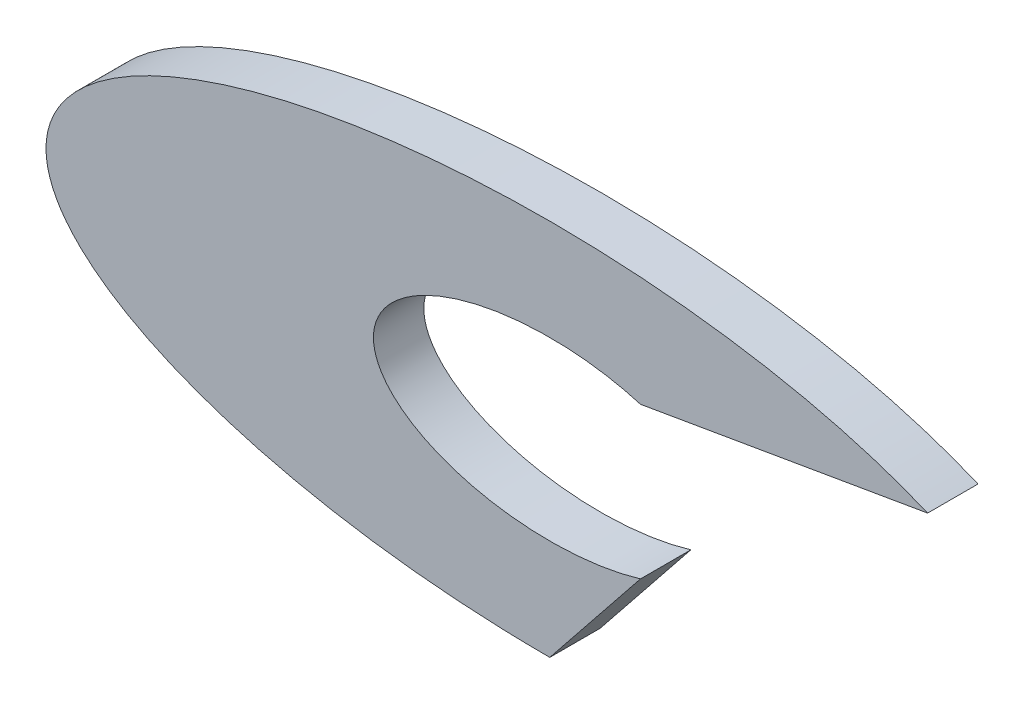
ISO-10303-21;
HEADER;
FILE_DESCRIPTION(('STEP AP214'),'2;1');
FILE_NAME('part.step','',(''),(''),'','','');
FILE_SCHEMA(('AUTOMOTIVE_DESIGN { 1 0 10303 214 1 1 1 1 }'));
ENDSEC;
DATA;
#1=APPLICATION_CONTEXT('core data for automotive mechanical design processes');
#2=APPLICATION_PROTOCOL_DEFINITION('international standard','automotive_design',2000,#1);
#3=PRODUCT_CONTEXT('',#1,'mechanical');
#4=PRODUCT('Part','Part','',(#3));
#5=PRODUCT_RELATED_PRODUCT_CATEGORY('part','',(#4));
#6=PRODUCT_DEFINITION_FORMATION('','',#4);
#7=PRODUCT_DEFINITION_CONTEXT('part definition',#1,'design');
#8=PRODUCT_DEFINITION('design','',#6,#7);
#9=PRODUCT_DEFINITION_SHAPE('','',#8);
#10=(LENGTH_UNIT() NAMED_UNIT(*) SI_UNIT(.MILLI.,.METRE.));
#11=(NAMED_UNIT(*) PLANE_ANGLE_UNIT() SI_UNIT($,.RADIAN.));
#12=(NAMED_UNIT(*) SI_UNIT($,.STERADIAN.) SOLID_ANGLE_UNIT());
#13=UNCERTAINTY_MEASURE_WITH_UNIT(LENGTH_MEASURE(1.E-05),#10,'distance_accuracy_value','');
#14=(GEOMETRIC_REPRESENTATION_CONTEXT(3) GLOBAL_UNCERTAINTY_ASSIGNED_CONTEXT((#13)) GLOBAL_UNIT_ASSIGNED_CONTEXT((#10,
#11,#12)) REPRESENTATION_CONTEXT('',''));
#15=CARTESIAN_POINT('',(0.,0.,0.));
#16=DIRECTION('',(0.,0.,1.));
#17=DIRECTION('',(1.,0.,0.));
#18=AXIS2_PLACEMENT_3D('',#15,#16,#17);
#19=CARTESIAN_POINT('',(0.,0.,10.));
#20=DIRECTION('',(0.,0.,-1.));
#21=DIRECTION('',(1.,0.,0.));
#22=AXIS2_PLACEMENT_3D('',#19,#20,#21);
#23=ELLIPSE('',#22,35.,17.5);
#24=DIRECTION('',(0.,0.,-1.));
#25=VECTOR('',#24,1.);
#26=SURFACE_OF_LINEAR_EXTRUSION('',#23,#25);
#27=CARTESIAN_POINT('',(0.,0.,0.));
#28=DIRECTION('',(0.,0.,-1.));
#29=DIRECTION('',(1.,0.,0.));
#30=AXIS2_PLACEMENT_3D('',#27,#28,#29);
#31=ELLIPSE('',#30,35.,17.5);
#32=CARTESIAN_POINT('',(18.,-15.0083310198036,0.));
#33=VERTEX_POINT('',#32);
#34=CARTESIAN_POINT('',(18.,15.0083310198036,0.));
#35=VERTEX_POINT('',#34);
#36=EDGE_CURVE('E111',#33,#35,#31,.T.);
#37=ORIENTED_EDGE('',*,*,#36,.T.);
#38=DIRECTION('',(0.,0.,-1.));
#39=VECTOR('',#38,1.);
#40=CARTESIAN_POINT('',(18.,15.0083310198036,10.));
#41=LINE('',#40,#39);
#42=CARTESIAN_POINT('',(18.,15.0083310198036,10.));
#43=VERTEX_POINT('',#42);
#44=EDGE_CURVE('E11',#43,#35,#41,.T.);
#45=ORIENTED_EDGE('',*,*,#44,.F.);
#46=CARTESIAN_POINT('',(18.,-15.0083310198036,10.));
#47=VERTEX_POINT('',#46);
#48=EDGE_CURVE('E85',#47,#43,#23,.T.);
#49=ORIENTED_EDGE('',*,*,#48,.F.);
#50=DIRECTION('',(0.,0.,-1.));
#51=VECTOR('',#50,1.);
#52=CARTESIAN_POINT('',(18.,-15.0083310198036,10.));
#53=LINE('',#52,#51);
#54=EDGE_CURVE('E93',#47,#33,#53,.T.);
#55=ORIENTED_EDGE('',*,*,#54,.T.);
#56=EDGE_LOOP('',(#37,#45,#49,#55));
#57=FACE_BOUND('',#56,.T.);
#58=ADVANCED_FACE('F33',(#57),#26,.F.);
#59=CARTESIAN_POINT('',(18.,15.0083310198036,10.));
#60=DIRECTION('',(-0.169369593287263,0.985552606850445,0.));
#61=DIRECTION('',(-0.985552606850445,-0.169369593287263,0.));
#62=AXIS2_PLACEMENT_3D('',#59,#60,#61);
#63=PLANE('',#62);
#64=DIRECTION('',(0.985552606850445,0.169369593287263,0.));
#65=VECTOR('',#64,1.);
#66=CARTESIAN_POINT('',(18.,15.0083310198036,0.));
#67=LINE('',#66,#65);
#68=CARTESIAN_POINT('',(75.,24.8039185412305,0.));
#69=VERTEX_POINT('',#68);
#70=EDGE_CURVE('E89',#35,#69,#67,.T.);
#71=ORIENTED_EDGE('',*,*,#70,.T.);
#72=DIRECTION('',(0.,0.,-1.));
#73=VECTOR('',#72,1.);
#74=CARTESIAN_POINT('',(75.,24.8039185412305,10.));
#75=LINE('',#74,#73);
#76=CARTESIAN_POINT('',(75.,24.8039185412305,10.));
#77=VERTEX_POINT('',#76);
#78=EDGE_CURVE('E42',#77,#69,#75,.T.);
#79=ORIENTED_EDGE('',*,*,#78,.F.);
#80=DIRECTION('',(0.985552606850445,0.169369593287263,0.));
#81=VECTOR('',#80,1.);
#82=CARTESIAN_POINT('',(18.,15.0083310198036,10.));
#83=LINE('',#82,#81);
#84=EDGE_CURVE('E80',#43,#77,#83,.T.);
#85=ORIENTED_EDGE('',*,*,#84,.F.);
#86=ORIENTED_EDGE('',*,*,#44,.T.);
#87=EDGE_LOOP('',(#71,#79,#85,#86));
#88=FACE_BOUND('',#87,.T.);
#89=ADVANCED_FACE('F88',(#88),#63,.F.);
#90=CARTESIAN_POINT('',(0.,0.,10.));
#91=DIRECTION('',(0.,0.,1.));
#92=DIRECTION('',(1.,0.,0.));
#93=AXIS2_PLACEMENT_3D('',#90,#91,#92);
#94=ELLIPSE('',#93,100.,37.5);
#95=DIRECTION('',(0.,0.,-1.));
#96=VECTOR('',#95,1.);
#97=SURFACE_OF_LINEAR_EXTRUSION('',#94,#96);
#98=CARTESIAN_POINT('',(0.,0.,0.));
#99=DIRECTION('',(0.,0.,1.));
#100=DIRECTION('',(1.,0.,0.));
#101=AXIS2_PLACEMENT_3D('',#98,#99,#100);
#102=ELLIPSE('',#101,100.,37.5);
#103=CARTESIAN_POINT('',(0.,-37.5,0.));
#104=VERTEX_POINT('',#103);
#105=EDGE_CURVE('E67',#69,#104,#102,.T.);
#106=ORIENTED_EDGE('',*,*,#105,.T.);
#107=DIRECTION('',(0.,0.,-1.));
#108=VECTOR('',#107,1.);
#109=CARTESIAN_POINT('',(0.,-37.5,10.));
#110=LINE('',#109,#108);
#111=CARTESIAN_POINT('',(0.,-37.5,10.));
#112=VERTEX_POINT('',#111);
#113=EDGE_CURVE('E90',#112,#104,#110,.T.);
#114=ORIENTED_EDGE('',*,*,#113,.F.);
#115=EDGE_CURVE('E83',#77,#112,#94,.T.);
#116=ORIENTED_EDGE('',*,*,#115,.F.);
#117=ORIENTED_EDGE('',*,*,#78,.T.);
#118=EDGE_LOOP('',(#106,#114,#116,#117));
#119=FACE_BOUND('',#118,.T.);
#120=ADVANCED_FACE('F91',(#119),#97,.F.);
#121=CARTESIAN_POINT('',(18.,-15.0083310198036,10.));
#122=DIRECTION('',(-0.780755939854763,0.624836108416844,0.));
#123=DIRECTION('',(-0.624836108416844,-0.780755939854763,0.));
#124=AXIS2_PLACEMENT_3D('',#121,#122,#123);
#125=PLANE('',#124);
#126=DIRECTION('',(0.624836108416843,0.780755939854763,0.));
#127=VECTOR('',#126,1.);
#128=CARTESIAN_POINT('',(18.,-15.0083310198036,0.));
#129=LINE('',#128,#127);
#130=EDGE_CURVE('E73',#104,#33,#129,.T.);
#131=ORIENTED_EDGE('',*,*,#130,.T.);
#132=ORIENTED_EDGE('',*,*,#54,.F.);
#133=DIRECTION('',(0.624836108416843,0.780755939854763,0.));
#134=VECTOR('',#133,1.);
#135=CARTESIAN_POINT('',(18.,-15.0083310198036,10.));
#136=LINE('',#135,#134);
#137=EDGE_CURVE('E50',#112,#47,#136,.T.);
#138=ORIENTED_EDGE('',*,*,#137,.F.);
#139=ORIENTED_EDGE('',*,*,#113,.T.);
#140=EDGE_LOOP('',(#131,#132,#138,#139));
#141=FACE_BOUND('',#140,.T.);
#142=ADVANCED_FACE('F100',(#141),#125,.F.);
#143=CARTESIAN_POINT('',(0.,0.,10.));
#144=DIRECTION('',(0.,0.,1.));
#145=DIRECTION('',(1.,0.,0.));
#146=AXIS2_PLACEMENT_3D('',#143,#144,#145);
#147=PLANE('',#146);
#148=ORIENTED_EDGE('',*,*,#48,.T.);
#149=ORIENTED_EDGE('',*,*,#84,.T.);
#150=ORIENTED_EDGE('',*,*,#115,.T.);
#151=ORIENTED_EDGE('',*,*,#137,.T.);
#152=EDGE_LOOP('',(#148,#149,#150,#151));
#153=FACE_BOUND('',#152,.T.);
#154=ADVANCED_FACE('F81',(#153),#147,.T.);
#155=CARTESIAN_POINT('',(0.,0.,0.));
#156=DIRECTION('',(0.,0.,1.));
#157=DIRECTION('',(1.,0.,0.));
#158=AXIS2_PLACEMENT_3D('',#155,#156,#157);
#159=PLANE('',#158);
#160=ORIENTED_EDGE('',*,*,#36,.F.);
#161=ORIENTED_EDGE('',*,*,#130,.F.);
#162=ORIENTED_EDGE('',*,*,#105,.F.);
#163=ORIENTED_EDGE('',*,*,#70,.F.);
#164=EDGE_LOOP('',(#160,#161,#162,#163));
#165=FACE_BOUND('',#164,.T.);
#166=ADVANCED_FACE('F118',(#165),#159,.F.);
#167=CLOSED_SHELL('',(#58,#89,#120,#142,#154,#166));
#168=MANIFOLD_SOLID_BREP('B2',#167);
#169=ADVANCED_BREP_SHAPE_REPRESENTATION('',(#18,#168),#14);
#170=SHAPE_DEFINITION_REPRESENTATION(#9,#169);
ENDSEC;
END-ISO-10303-21;
